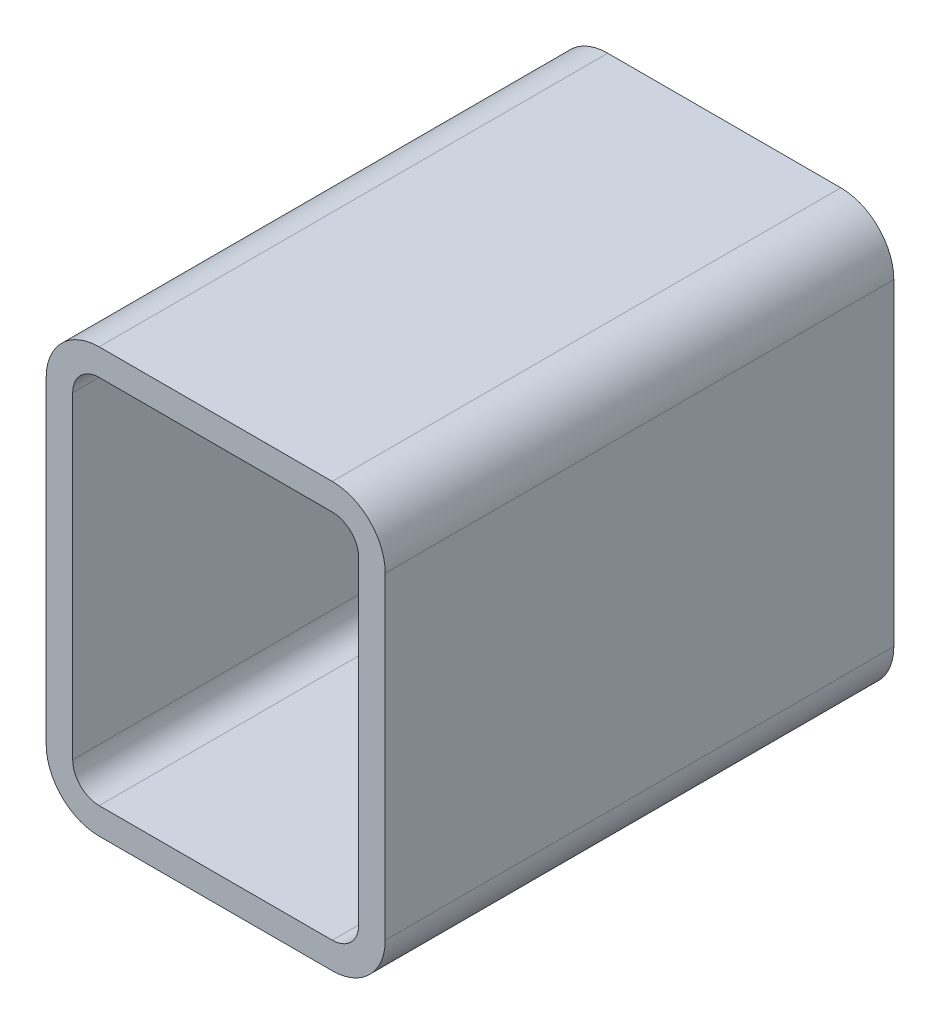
ISO-10303-21;
HEADER;
FILE_DESCRIPTION(('STEP AP214'),'2;1');
FILE_NAME('part.step','',(''),(''),'','','');
FILE_SCHEMA(('AUTOMOTIVE_DESIGN { 1 0 10303 214 1 1 1 1 }'));
ENDSEC;
DATA;
#1=APPLICATION_CONTEXT('core data for automotive mechanical design processes');
#2=APPLICATION_PROTOCOL_DEFINITION('international standard','automotive_design',2000,#1);
#3=PRODUCT_CONTEXT('',#1,'mechanical');
#4=PRODUCT('Part','Part','',(#3));
#5=PRODUCT_RELATED_PRODUCT_CATEGORY('part','',(#4));
#6=PRODUCT_DEFINITION_FORMATION('','',#4);
#7=PRODUCT_DEFINITION_CONTEXT('part definition',#1,'design');
#8=PRODUCT_DEFINITION('design','',#6,#7);
#9=PRODUCT_DEFINITION_SHAPE('','',#8);
#10=(LENGTH_UNIT() NAMED_UNIT(*) SI_UNIT(.MILLI.,.METRE.));
#11=(NAMED_UNIT(*) PLANE_ANGLE_UNIT() SI_UNIT($,.RADIAN.));
#12=(NAMED_UNIT(*) SI_UNIT($,.STERADIAN.) SOLID_ANGLE_UNIT());
#13=UNCERTAINTY_MEASURE_WITH_UNIT(LENGTH_MEASURE(1.E-05),#10,'distance_accuracy_value','');
#14=(GEOMETRIC_REPRESENTATION_CONTEXT(3) GLOBAL_UNCERTAINTY_ASSIGNED_CONTEXT((#13)) GLOBAL_UNIT_ASSIGNED_CONTEXT((#10,
#11,#12)) REPRESENTATION_CONTEXT('',''));
#15=CARTESIAN_POINT('',(0.,0.,0.));
#16=DIRECTION('',(0.,0.,1.));
#17=DIRECTION('',(1.,0.,0.));
#18=AXIS2_PLACEMENT_3D('',#15,#16,#17);
#19=CARTESIAN_POINT('',(33.1409404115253,224.170313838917,304.8));
#20=DIRECTION('',(0.,0.,1.));
#21=DIRECTION('',(1.,0.,0.));
#22=AXIS2_PLACEMENT_3D('',#19,#20,#21);
#23=PLANE('',#22);
#24=CARTESIAN_POINT('',(33.1409404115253,224.170313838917,304.8));
#25=DIRECTION('',(0.,0.,1.));
#26=DIRECTION('',(1.,0.,0.));
#27=AXIS2_PLACEMENT_3D('',#24,#25,#26);
#28=CIRCLE('',#27,31.75);
#29=CARTESIAN_POINT('',(33.1409404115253,255.920313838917,304.8));
#30=VERTEX_POINT('',#29);
#31=CARTESIAN_POINT('',(1.3909404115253,224.170313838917,304.8));
#32=VERTEX_POINT('',#31);
#33=EDGE_CURVE('E211',#30,#32,#28,.T.);
#34=ORIENTED_EDGE('',*,*,#33,.T.);
#35=DIRECTION('',(0.,-1.,0.));
#36=VECTOR('',#35,1.);
#37=CARTESIAN_POINT('',(1.3909404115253,33.6703138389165,304.8));
#38=LINE('',#37,#36);
#39=CARTESIAN_POINT('',(1.3909404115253,33.6703138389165,304.8));
#40=VERTEX_POINT('',#39);
#41=EDGE_CURVE('E214',#32,#40,#38,.T.);
#42=ORIENTED_EDGE('',*,*,#41,.T.);
#43=CARTESIAN_POINT('',(33.1409404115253,33.6703138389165,304.8));
#44=DIRECTION('',(0.,0.,1.));
#45=DIRECTION('',(1.,0.,0.));
#46=AXIS2_PLACEMENT_3D('',#43,#44,#45);
#47=CIRCLE('',#46,31.75);
#48=CARTESIAN_POINT('',(33.1409404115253,1.92031383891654,304.8));
#49=VERTEX_POINT('',#48);
#50=EDGE_CURVE('E217',#40,#49,#47,.T.);
#51=ORIENTED_EDGE('',*,*,#50,.T.);
#52=DIRECTION('',(1.,0.,0.));
#53=VECTOR('',#52,1.);
#54=CARTESIAN_POINT('',(172.840940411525,1.92031383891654,304.8));
#55=LINE('',#54,#53);
#56=CARTESIAN_POINT('',(172.840940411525,1.92031383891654,304.8));
#57=VERTEX_POINT('',#56);
#58=EDGE_CURVE('E219',#49,#57,#55,.T.);
#59=ORIENTED_EDGE('',*,*,#58,.T.);
#60=CARTESIAN_POINT('',(172.840940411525,33.6703138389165,304.8));
#61=DIRECTION('',(0.,0.,1.));
#62=DIRECTION('',(1.,0.,0.));
#63=AXIS2_PLACEMENT_3D('',#60,#61,#62);
#64=CIRCLE('',#63,31.75);
#65=CARTESIAN_POINT('',(204.590940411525,33.6703138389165,304.8));
#66=VERTEX_POINT('',#65);
#67=EDGE_CURVE('E221',#57,#66,#64,.T.);
#68=ORIENTED_EDGE('',*,*,#67,.T.);
#69=DIRECTION('',(0.,1.,0.));
#70=VECTOR('',#69,1.);
#71=CARTESIAN_POINT('',(204.590940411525,224.170313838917,304.8));
#72=LINE('',#71,#70);
#73=CARTESIAN_POINT('',(204.590940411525,224.170313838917,304.8));
#74=VERTEX_POINT('',#73);
#75=EDGE_CURVE('E223',#66,#74,#72,.T.);
#76=ORIENTED_EDGE('',*,*,#75,.T.);
#77=CARTESIAN_POINT('',(172.840940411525,224.170313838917,304.8));
#78=DIRECTION('',(0.,0.,1.));
#79=DIRECTION('',(1.,0.,0.));
#80=AXIS2_PLACEMENT_3D('',#77,#78,#79);
#81=CIRCLE('',#80,31.75);
#82=CARTESIAN_POINT('',(172.840940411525,255.920313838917,304.8));
#83=VERTEX_POINT('',#82);
#84=EDGE_CURVE('E225',#74,#83,#81,.T.);
#85=ORIENTED_EDGE('',*,*,#84,.T.);
#86=DIRECTION('',(-1.,0.,0.));
#87=VECTOR('',#86,1.);
#88=CARTESIAN_POINT('',(33.1409404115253,255.920313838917,304.8));
#89=LINE('',#88,#87);
#90=EDGE_CURVE('E227',#83,#30,#89,.T.);
#91=ORIENTED_EDGE('',*,*,#90,.T.);
#92=EDGE_LOOP('',(#34,#42,#51,#59,#68,#76,#85,#91));
#93=FACE_BOUND('',#92,.T.);
#94=DIRECTION('',(0.,-1.,0.));
#95=VECTOR('',#94,1.);
#96=CARTESIAN_POINT('',(17.2659404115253,33.6703138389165,304.8));
#97=LINE('',#96,#95);
#98=CARTESIAN_POINT('',(17.2659404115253,224.170313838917,304.8));
#99=VERTEX_POINT('',#98);
#100=CARTESIAN_POINT('',(17.2659404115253,33.6703138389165,304.8));
#101=VERTEX_POINT('',#100);
#102=EDGE_CURVE('E154',#99,#101,#97,.T.);
#103=ORIENTED_EDGE('',*,*,#102,.F.);
#104=CARTESIAN_POINT('',(33.1409404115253,224.170313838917,304.8));
#105=DIRECTION('',(0.,0.,1.));
#106=DIRECTION('',(1.,0.,0.));
#107=AXIS2_PLACEMENT_3D('',#104,#105,#106);
#108=CIRCLE('',#107,15.875);
#109=CARTESIAN_POINT('',(33.1409404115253,240.045313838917,304.8));
#110=VERTEX_POINT('',#109);
#111=EDGE_CURVE('E146',#110,#99,#108,.T.);
#112=ORIENTED_EDGE('',*,*,#111,.F.);
#113=DIRECTION('',(-1.,0.,0.));
#114=VECTOR('',#113,1.);
#115=CARTESIAN_POINT('',(33.1409404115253,240.045313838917,304.8));
#116=LINE('',#115,#114);
#117=CARTESIAN_POINT('',(172.840940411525,240.045313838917,304.8));
#118=VERTEX_POINT('',#117);
#119=EDGE_CURVE('E179',#118,#110,#116,.T.);
#120=ORIENTED_EDGE('',*,*,#119,.F.);
#121=CARTESIAN_POINT('',(172.840940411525,224.170313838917,304.8));
#122=DIRECTION('',(0.,0.,1.));
#123=DIRECTION('',(1.,0.,0.));
#124=AXIS2_PLACEMENT_3D('',#121,#122,#123);
#125=CIRCLE('',#124,15.875);
#126=CARTESIAN_POINT('',(188.715940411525,224.170313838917,304.8));
#127=VERTEX_POINT('',#126);
#128=EDGE_CURVE('E177',#127,#118,#125,.T.);
#129=ORIENTED_EDGE('',*,*,#128,.F.);
#130=DIRECTION('',(0.,1.,0.));
#131=VECTOR('',#130,1.);
#132=CARTESIAN_POINT('',(188.715940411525,224.170313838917,304.8));
#133=LINE('',#132,#131);
#134=CARTESIAN_POINT('',(188.715940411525,33.6703138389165,304.8));
#135=VERTEX_POINT('',#134);
#136=EDGE_CURVE('E175',#135,#127,#133,.T.);
#137=ORIENTED_EDGE('',*,*,#136,.F.);
#138=CARTESIAN_POINT('',(172.840940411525,33.6703138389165,304.8));
#139=DIRECTION('',(0.,0.,1.));
#140=DIRECTION('',(1.,0.,0.));
#141=AXIS2_PLACEMENT_3D('',#138,#139,#140);
#142=CIRCLE('',#141,15.875);
#143=CARTESIAN_POINT('',(172.840940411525,17.7953138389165,304.8));
#144=VERTEX_POINT('',#143);
#145=EDGE_CURVE('E173',#144,#135,#142,.T.);
#146=ORIENTED_EDGE('',*,*,#145,.F.);
#147=DIRECTION('',(1.,0.,0.));
#148=VECTOR('',#147,1.);
#149=CARTESIAN_POINT('',(172.840940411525,17.7953138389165,304.8));
#150=LINE('',#149,#148);
#151=CARTESIAN_POINT('',(33.1409404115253,17.7953138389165,304.8));
#152=VERTEX_POINT('',#151);
#153=EDGE_CURVE('E169',#152,#144,#150,.T.);
#154=ORIENTED_EDGE('',*,*,#153,.F.);
#155=CARTESIAN_POINT('',(33.1409404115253,33.6703138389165,304.8));
#156=DIRECTION('',(0.,0.,1.));
#157=DIRECTION('',(1.,0.,0.));
#158=AXIS2_PLACEMENT_3D('',#155,#156,#157);
#159=CIRCLE('',#158,15.875);
#160=EDGE_CURVE('E167',#101,#152,#159,.T.);
#161=ORIENTED_EDGE('',*,*,#160,.F.);
#162=EDGE_LOOP('',(#103,#112,#120,#129,#137,#146,#154,#161));
#163=FACE_BOUND('',#162,.T.);
#164=ADVANCED_FACE('F33',(#93,#163),#23,.T.);
#165=CARTESIAN_POINT('',(33.1409404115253,224.170313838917,0.));
#166=DIRECTION('',(0.,0.,1.));
#167=DIRECTION('',(1.,0.,0.));
#168=AXIS2_PLACEMENT_3D('',#165,#166,#167);
#169=PLANE('',#168);
#170=CARTESIAN_POINT('',(33.1409404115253,224.170313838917,0.));
#171=DIRECTION('',(0.,0.,1.));
#172=DIRECTION('',(1.,0.,0.));
#173=AXIS2_PLACEMENT_3D('',#170,#171,#172);
#174=CIRCLE('',#173,31.75);
#175=CARTESIAN_POINT('',(33.1409404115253,255.920313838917,0.));
#176=VERTEX_POINT('',#175);
#177=CARTESIAN_POINT('',(1.3909404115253,224.170313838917,0.));
#178=VERTEX_POINT('',#177);
#179=EDGE_CURVE('E162',#176,#178,#174,.T.);
#180=ORIENTED_EDGE('',*,*,#179,.F.);
#181=DIRECTION('',(-1.,0.,0.));
#182=VECTOR('',#181,1.);
#183=CARTESIAN_POINT('',(33.1409404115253,255.920313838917,0.));
#184=LINE('',#183,#182);
#185=CARTESIAN_POINT('',(172.840940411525,255.920313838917,0.));
#186=VERTEX_POINT('',#185);
#187=EDGE_CURVE('E215',#186,#176,#184,.T.);
#188=ORIENTED_EDGE('',*,*,#187,.F.);
#189=CARTESIAN_POINT('',(172.840940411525,224.170313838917,0.));
#190=DIRECTION('',(0.,0.,1.));
#191=DIRECTION('',(1.,0.,0.));
#192=AXIS2_PLACEMENT_3D('',#189,#190,#191);
#193=CIRCLE('',#192,31.75);
#194=CARTESIAN_POINT('',(204.590940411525,224.170313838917,0.));
#195=VERTEX_POINT('',#194);
#196=EDGE_CURVE('E242',#195,#186,#193,.T.);
#197=ORIENTED_EDGE('',*,*,#196,.F.);
#198=DIRECTION('',(0.,1.,0.));
#199=VECTOR('',#198,1.);
#200=CARTESIAN_POINT('',(204.590940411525,224.170313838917,0.));
#201=LINE('',#200,#199);
#202=CARTESIAN_POINT('',(204.590940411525,33.6703138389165,0.));
#203=VERTEX_POINT('',#202);
#204=EDGE_CURVE('E240',#203,#195,#201,.T.);
#205=ORIENTED_EDGE('',*,*,#204,.F.);
#206=CARTESIAN_POINT('',(172.840940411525,33.6703138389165,0.));
#207=DIRECTION('',(0.,0.,1.));
#208=DIRECTION('',(1.,0.,0.));
#209=AXIS2_PLACEMENT_3D('',#206,#207,#208);
#210=CIRCLE('',#209,31.75);
#211=CARTESIAN_POINT('',(172.840940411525,1.92031383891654,0.));
#212=VERTEX_POINT('',#211);
#213=EDGE_CURVE('E238',#212,#203,#210,.T.);
#214=ORIENTED_EDGE('',*,*,#213,.F.);
#215=DIRECTION('',(1.,0.,0.));
#216=VECTOR('',#215,1.);
#217=CARTESIAN_POINT('',(172.840940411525,1.92031383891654,0.));
#218=LINE('',#217,#216);
#219=CARTESIAN_POINT('',(33.1409404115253,1.92031383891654,0.));
#220=VERTEX_POINT('',#219);
#221=EDGE_CURVE('E236',#220,#212,#218,.T.);
#222=ORIENTED_EDGE('',*,*,#221,.F.);
#223=CARTESIAN_POINT('',(33.1409404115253,33.6703138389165,0.));
#224=DIRECTION('',(0.,0.,1.));
#225=DIRECTION('',(1.,0.,0.));
#226=AXIS2_PLACEMENT_3D('',#223,#224,#225);
#227=CIRCLE('',#226,31.75);
#228=CARTESIAN_POINT('',(1.3909404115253,33.6703138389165,0.));
#229=VERTEX_POINT('',#228);
#230=EDGE_CURVE('E234',#229,#220,#227,.T.);
#231=ORIENTED_EDGE('',*,*,#230,.F.);
#232=DIRECTION('',(0.,-1.,0.));
#233=VECTOR('',#232,1.);
#234=CARTESIAN_POINT('',(1.3909404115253,33.6703138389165,0.));
#235=LINE('',#234,#233);
#236=EDGE_CURVE('E232',#178,#229,#235,.T.);
#237=ORIENTED_EDGE('',*,*,#236,.F.);
#238=EDGE_LOOP('',(#180,#188,#197,#205,#214,#222,#231,#237));
#239=FACE_BOUND('',#238,.T.);
#240=CARTESIAN_POINT('',(33.1409404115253,224.170313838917,0.));
#241=DIRECTION('',(0.,0.,1.));
#242=DIRECTION('',(1.,0.,0.));
#243=AXIS2_PLACEMENT_3D('',#240,#241,#242);
#244=CIRCLE('',#243,15.875);
#245=CARTESIAN_POINT('',(33.1409404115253,240.045313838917,0.));
#246=VERTEX_POINT('',#245);
#247=CARTESIAN_POINT('',(17.2659404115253,224.170313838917,0.));
#248=VERTEX_POINT('',#247);
#249=EDGE_CURVE('E56',#246,#248,#244,.T.);
#250=ORIENTED_EDGE('',*,*,#249,.T.);
#251=DIRECTION('',(0.,-1.,0.));
#252=VECTOR('',#251,1.);
#253=CARTESIAN_POINT('',(17.2659404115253,33.6703138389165,0.));
#254=LINE('',#253,#252);
#255=CARTESIAN_POINT('',(17.2659404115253,33.6703138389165,0.));
#256=VERTEX_POINT('',#255);
#257=EDGE_CURVE('E161',#248,#256,#254,.T.);
#258=ORIENTED_EDGE('',*,*,#257,.T.);
#259=CARTESIAN_POINT('',(33.1409404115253,33.6703138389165,0.));
#260=DIRECTION('',(0.,0.,1.));
#261=DIRECTION('',(1.,0.,0.));
#262=AXIS2_PLACEMENT_3D('',#259,#260,#261);
#263=CIRCLE('',#262,15.875);
#264=CARTESIAN_POINT('',(33.1409404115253,17.7953138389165,0.));
#265=VERTEX_POINT('',#264);
#266=EDGE_CURVE('E183',#256,#265,#263,.T.);
#267=ORIENTED_EDGE('',*,*,#266,.T.);
#268=DIRECTION('',(1.,0.,0.));
#269=VECTOR('',#268,1.);
#270=CARTESIAN_POINT('',(172.840940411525,17.7953138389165,0.));
#271=LINE('',#270,#269);
#272=CARTESIAN_POINT('',(172.840940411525,17.7953138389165,0.));
#273=VERTEX_POINT('',#272);
#274=EDGE_CURVE('E186',#265,#273,#271,.T.);
#275=ORIENTED_EDGE('',*,*,#274,.T.);
#276=CARTESIAN_POINT('',(172.840940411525,33.6703138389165,0.));
#277=DIRECTION('',(0.,0.,1.));
#278=DIRECTION('',(1.,0.,0.));
#279=AXIS2_PLACEMENT_3D('',#276,#277,#278);
#280=CIRCLE('',#279,15.875);
#281=CARTESIAN_POINT('',(188.715940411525,33.6703138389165,0.));
#282=VERTEX_POINT('',#281);
#283=EDGE_CURVE('E189',#273,#282,#280,.T.);
#284=ORIENTED_EDGE('',*,*,#283,.T.);
#285=DIRECTION('',(0.,1.,0.));
#286=VECTOR('',#285,1.);
#287=CARTESIAN_POINT('',(188.715940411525,224.170313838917,0.));
#288=LINE('',#287,#286);
#289=CARTESIAN_POINT('',(188.715940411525,224.170313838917,0.));
#290=VERTEX_POINT('',#289);
#291=EDGE_CURVE('E192',#282,#290,#288,.T.);
#292=ORIENTED_EDGE('',*,*,#291,.T.);
#293=CARTESIAN_POINT('',(172.840940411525,224.170313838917,0.));
#294=DIRECTION('',(0.,0.,1.));
#295=DIRECTION('',(1.,0.,0.));
#296=AXIS2_PLACEMENT_3D('',#293,#294,#295);
#297=CIRCLE('',#296,15.875);
#298=CARTESIAN_POINT('',(172.840940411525,240.045313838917,0.));
#299=VERTEX_POINT('',#298);
#300=EDGE_CURVE('E195',#290,#299,#297,.T.);
#301=ORIENTED_EDGE('',*,*,#300,.T.);
#302=DIRECTION('',(-1.,0.,0.));
#303=VECTOR('',#302,1.);
#304=CARTESIAN_POINT('',(33.1409404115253,240.045313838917,0.));
#305=LINE('',#304,#303);
#306=EDGE_CURVE('E155',#299,#246,#305,.T.);
#307=ORIENTED_EDGE('',*,*,#306,.T.);
#308=EDGE_LOOP('',(#250,#258,#267,#275,#284,#292,#301,#307));
#309=FACE_BOUND('',#308,.T.);
#310=ADVANCED_FACE('F272',(#239,#309),#169,.F.);
#311=CARTESIAN_POINT('',(33.1409404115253,224.170313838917,304.8));
#312=DIRECTION('',(0.,0.,-1.));
#313=DIRECTION('',(-1.,0.,0.));
#314=AXIS2_PLACEMENT_3D('',#311,#312,#313);
#315=CYLINDRICAL_SURFACE('',#314,31.75);
#316=ORIENTED_EDGE('',*,*,#179,.T.);
#317=DIRECTION('',(0.,0.,-1.));
#318=VECTOR('',#317,1.);
#319=CARTESIAN_POINT('',(1.3909404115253,224.170313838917,304.8));
#320=LINE('',#319,#318);
#321=EDGE_CURVE('E11',#32,#178,#320,.T.);
#322=ORIENTED_EDGE('',*,*,#321,.F.);
#323=ORIENTED_EDGE('',*,*,#33,.F.);
#324=DIRECTION('',(0.,0.,-1.));
#325=VECTOR('',#324,1.);
#326=CARTESIAN_POINT('',(33.1409404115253,255.920313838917,304.8));
#327=LINE('',#326,#325);
#328=EDGE_CURVE('E229',#30,#176,#327,.T.);
#329=ORIENTED_EDGE('',*,*,#328,.T.);
#330=EDGE_LOOP('',(#316,#322,#323,#329));
#331=FACE_BOUND('',#330,.T.);
#332=ADVANCED_FACE('F35',(#331),#315,.T.);
#333=CARTESIAN_POINT('',(1.3909404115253,33.6703138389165,304.8));
#334=DIRECTION('',(1.,0.,0.));
#335=DIRECTION('',(0.,0.,-1.));
#336=AXIS2_PLACEMENT_3D('',#333,#334,#335);
#337=PLANE('',#336);
#338=ORIENTED_EDGE('',*,*,#236,.T.);
#339=DIRECTION('',(0.,0.,-1.));
#340=VECTOR('',#339,1.);
#341=CARTESIAN_POINT('',(1.3909404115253,33.6703138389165,304.8));
#342=LINE('',#341,#340);
#343=EDGE_CURVE('E41',#40,#229,#342,.T.);
#344=ORIENTED_EDGE('',*,*,#343,.F.);
#345=ORIENTED_EDGE('',*,*,#41,.F.);
#346=ORIENTED_EDGE('',*,*,#321,.T.);
#347=EDGE_LOOP('',(#338,#344,#345,#346));
#348=FACE_BOUND('',#347,.T.);
#349=ADVANCED_FACE('F289',(#348),#337,.F.);
#350=CARTESIAN_POINT('',(33.1409404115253,33.6703138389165,304.8));
#351=DIRECTION('',(0.,0.,-1.));
#352=DIRECTION('',(-1.,0.,0.));
#353=AXIS2_PLACEMENT_3D('',#350,#351,#352);
#354=CYLINDRICAL_SURFACE('',#353,31.75);
#355=ORIENTED_EDGE('',*,*,#230,.T.);
#356=DIRECTION('',(0.,0.,-1.));
#357=VECTOR('',#356,1.);
#358=CARTESIAN_POINT('',(33.1409404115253,1.92031383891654,304.8));
#359=LINE('',#358,#357);
#360=EDGE_CURVE('E259',#49,#220,#359,.T.);
#361=ORIENTED_EDGE('',*,*,#360,.F.);
#362=ORIENTED_EDGE('',*,*,#50,.F.);
#363=ORIENTED_EDGE('',*,*,#343,.T.);
#364=EDGE_LOOP('',(#355,#361,#362,#363));
#365=FACE_BOUND('',#364,.T.);
#366=ADVANCED_FACE('F266',(#365),#354,.T.);
#367=CARTESIAN_POINT('',(172.840940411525,1.92031383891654,304.8));
#368=DIRECTION('',(0.,1.,0.));
#369=DIRECTION('',(0.,0.,1.));
#370=AXIS2_PLACEMENT_3D('',#367,#368,#369);
#371=PLANE('',#370);
#372=ORIENTED_EDGE('',*,*,#221,.T.);
#373=DIRECTION('',(0.,0.,-1.));
#374=VECTOR('',#373,1.);
#375=CARTESIAN_POINT('',(172.840940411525,1.92031383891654,304.8));
#376=LINE('',#375,#374);
#377=EDGE_CURVE('E256',#57,#212,#376,.T.);
#378=ORIENTED_EDGE('',*,*,#377,.F.);
#379=ORIENTED_EDGE('',*,*,#58,.F.);
#380=ORIENTED_EDGE('',*,*,#360,.T.);
#381=EDGE_LOOP('',(#372,#378,#379,#380));
#382=FACE_BOUND('',#381,.T.);
#383=ADVANCED_FACE('F278',(#382),#371,.F.);
#384=CARTESIAN_POINT('',(172.840940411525,33.6703138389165,304.8));
#385=DIRECTION('',(0.,0.,-1.));
#386=DIRECTION('',(-1.,0.,0.));
#387=AXIS2_PLACEMENT_3D('',#384,#385,#386);
#388=CYLINDRICAL_SURFACE('',#387,31.75);
#389=ORIENTED_EDGE('',*,*,#213,.T.);
#390=DIRECTION('',(0.,0.,-1.));
#391=VECTOR('',#390,1.);
#392=CARTESIAN_POINT('',(204.590940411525,33.6703138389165,304.8));
#393=LINE('',#392,#391);
#394=EDGE_CURVE('E253',#66,#203,#393,.T.);
#395=ORIENTED_EDGE('',*,*,#394,.F.);
#396=ORIENTED_EDGE('',*,*,#67,.F.);
#397=ORIENTED_EDGE('',*,*,#377,.T.);
#398=EDGE_LOOP('',(#389,#395,#396,#397));
#399=FACE_BOUND('',#398,.T.);
#400=ADVANCED_FACE('F282',(#399),#388,.T.);
#401=CARTESIAN_POINT('',(204.590940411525,224.170313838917,304.8));
#402=DIRECTION('',(-1.,0.,0.));
#403=DIRECTION('',(0.,0.,1.));
#404=AXIS2_PLACEMENT_3D('',#401,#402,#403);
#405=PLANE('',#404);
#406=ORIENTED_EDGE('',*,*,#204,.T.);
#407=DIRECTION('',(0.,0.,-1.));
#408=VECTOR('',#407,1.);
#409=CARTESIAN_POINT('',(204.590940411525,224.170313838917,304.8));
#410=LINE('',#409,#408);
#411=EDGE_CURVE('E250',#74,#195,#410,.T.);
#412=ORIENTED_EDGE('',*,*,#411,.F.);
#413=ORIENTED_EDGE('',*,*,#75,.F.);
#414=ORIENTED_EDGE('',*,*,#394,.T.);
#415=EDGE_LOOP('',(#406,#412,#413,#414));
#416=FACE_BOUND('',#415,.T.);
#417=ADVANCED_FACE('F302',(#416),#405,.F.);
#418=CARTESIAN_POINT('',(172.840940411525,224.170313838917,304.8));
#419=DIRECTION('',(0.,0.,-1.));
#420=DIRECTION('',(-1.,0.,0.));
#421=AXIS2_PLACEMENT_3D('',#418,#419,#420);
#422=CYLINDRICAL_SURFACE('',#421,31.75);
#423=ORIENTED_EDGE('',*,*,#196,.T.);
#424=DIRECTION('',(0.,0.,-1.));
#425=VECTOR('',#424,1.);
#426=CARTESIAN_POINT('',(172.840940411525,255.920313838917,304.8));
#427=LINE('',#426,#425);
#428=EDGE_CURVE('E247',#83,#186,#427,.T.);
#429=ORIENTED_EDGE('',*,*,#428,.F.);
#430=ORIENTED_EDGE('',*,*,#84,.F.);
#431=ORIENTED_EDGE('',*,*,#411,.T.);
#432=EDGE_LOOP('',(#423,#429,#430,#431));
#433=FACE_BOUND('',#432,.T.);
#434=ADVANCED_FACE('F300',(#433),#422,.T.);
#435=CARTESIAN_POINT('',(33.1409404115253,255.920313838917,304.8));
#436=DIRECTION('',(0.,-1.,0.));
#437=DIRECTION('',(0.,0.,-1.));
#438=AXIS2_PLACEMENT_3D('',#435,#436,#437);
#439=PLANE('',#438);
#440=ORIENTED_EDGE('',*,*,#187,.T.);
#441=ORIENTED_EDGE('',*,*,#328,.F.);
#442=ORIENTED_EDGE('',*,*,#90,.F.);
#443=ORIENTED_EDGE('',*,*,#428,.T.);
#444=EDGE_LOOP('',(#440,#441,#442,#443));
#445=FACE_BOUND('',#444,.T.);
#446=ADVANCED_FACE('F295',(#445),#439,.F.);
#447=CARTESIAN_POINT('',(33.1409404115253,224.170313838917,304.8));
#448=DIRECTION('',(0.,0.,-1.));
#449=DIRECTION('',(-1.,0.,0.));
#450=AXIS2_PLACEMENT_3D('',#447,#448,#449);
#451=CYLINDRICAL_SURFACE('',#450,15.875);
#452=ORIENTED_EDGE('',*,*,#249,.F.);
#453=DIRECTION('',(0.,0.,-1.));
#454=VECTOR('',#453,1.);
#455=CARTESIAN_POINT('',(33.1409404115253,240.045313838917,304.8));
#456=LINE('',#455,#454);
#457=EDGE_CURVE('E150',#110,#246,#456,.T.);
#458=ORIENTED_EDGE('',*,*,#457,.F.);
#459=ORIENTED_EDGE('',*,*,#111,.T.);
#460=DIRECTION('',(0.,0.,-1.));
#461=VECTOR('',#460,1.);
#462=CARTESIAN_POINT('',(17.2659404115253,224.170313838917,304.8));
#463=LINE('',#462,#461);
#464=EDGE_CURVE('E149',#99,#248,#463,.T.);
#465=ORIENTED_EDGE('',*,*,#464,.T.);
#466=EDGE_LOOP('',(#452,#458,#459,#465));
#467=FACE_BOUND('',#466,.T.);
#468=ADVANCED_FACE('F148',(#467),#451,.F.);
#469=CARTESIAN_POINT('',(17.2659404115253,33.6703138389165,304.8));
#470=DIRECTION('',(1.,0.,0.));
#471=DIRECTION('',(0.,0.,-1.));
#472=AXIS2_PLACEMENT_3D('',#469,#470,#471);
#473=PLANE('',#472);
#474=ORIENTED_EDGE('',*,*,#257,.F.);
#475=ORIENTED_EDGE('',*,*,#464,.F.);
#476=ORIENTED_EDGE('',*,*,#102,.T.);
#477=DIRECTION('',(0.,0.,-1.));
#478=VECTOR('',#477,1.);
#479=CARTESIAN_POINT('',(17.2659404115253,33.6703138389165,304.8));
#480=LINE('',#479,#478);
#481=EDGE_CURVE('E163',#101,#256,#480,.T.);
#482=ORIENTED_EDGE('',*,*,#481,.T.);
#483=EDGE_LOOP('',(#474,#475,#476,#482));
#484=FACE_BOUND('',#483,.T.);
#485=ADVANCED_FACE('F158',(#484),#473,.T.);
#486=CARTESIAN_POINT('',(33.1409404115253,33.6703138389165,304.8));
#487=DIRECTION('',(0.,0.,-1.));
#488=DIRECTION('',(-1.,0.,0.));
#489=AXIS2_PLACEMENT_3D('',#486,#487,#488);
#490=CYLINDRICAL_SURFACE('',#489,15.875);
#491=ORIENTED_EDGE('',*,*,#266,.F.);
#492=ORIENTED_EDGE('',*,*,#481,.F.);
#493=ORIENTED_EDGE('',*,*,#160,.T.);
#494=DIRECTION('',(0.,0.,-1.));
#495=VECTOR('',#494,1.);
#496=CARTESIAN_POINT('',(33.1409404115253,17.7953138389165,304.8));
#497=LINE('',#496,#495);
#498=EDGE_CURVE('E208',#152,#265,#497,.T.);
#499=ORIENTED_EDGE('',*,*,#498,.T.);
#500=EDGE_LOOP('',(#491,#492,#493,#499));
#501=FACE_BOUND('',#500,.T.);
#502=ADVANCED_FACE('F327',(#501),#490,.F.);
#503=CARTESIAN_POINT('',(172.840940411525,17.7953138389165,304.8));
#504=DIRECTION('',(0.,1.,0.));
#505=DIRECTION('',(0.,0.,1.));
#506=AXIS2_PLACEMENT_3D('',#503,#504,#505);
#507=PLANE('',#506);
#508=ORIENTED_EDGE('',*,*,#274,.F.);
#509=ORIENTED_EDGE('',*,*,#498,.F.);
#510=ORIENTED_EDGE('',*,*,#153,.T.);
#511=DIRECTION('',(0.,0.,-1.));
#512=VECTOR('',#511,1.);
#513=CARTESIAN_POINT('',(172.840940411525,17.7953138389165,304.8));
#514=LINE('',#513,#512);
#515=EDGE_CURVE('E206',#144,#273,#514,.T.);
#516=ORIENTED_EDGE('',*,*,#515,.T.);
#517=EDGE_LOOP('',(#508,#509,#510,#516));
#518=FACE_BOUND('',#517,.T.);
#519=ADVANCED_FACE('F331',(#518),#507,.T.);
#520=CARTESIAN_POINT('',(172.840940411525,33.6703138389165,304.8));
#521=DIRECTION('',(0.,0.,-1.));
#522=DIRECTION('',(-1.,0.,0.));
#523=AXIS2_PLACEMENT_3D('',#520,#521,#522);
#524=CYLINDRICAL_SURFACE('',#523,15.875);
#525=ORIENTED_EDGE('',*,*,#283,.F.);
#526=ORIENTED_EDGE('',*,*,#515,.F.);
#527=ORIENTED_EDGE('',*,*,#145,.T.);
#528=DIRECTION('',(0.,0.,-1.));
#529=VECTOR('',#528,1.);
#530=CARTESIAN_POINT('',(188.715940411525,33.6703138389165,304.8));
#531=LINE('',#530,#529);
#532=EDGE_CURVE('E204',#135,#282,#531,.T.);
#533=ORIENTED_EDGE('',*,*,#532,.T.);
#534=EDGE_LOOP('',(#525,#526,#527,#533));
#535=FACE_BOUND('',#534,.T.);
#536=ADVANCED_FACE('F337',(#535),#524,.F.);
#537=CARTESIAN_POINT('',(188.715940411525,224.170313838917,304.8));
#538=DIRECTION('',(-1.,0.,0.));
#539=DIRECTION('',(0.,0.,1.));
#540=AXIS2_PLACEMENT_3D('',#537,#538,#539);
#541=PLANE('',#540);
#542=ORIENTED_EDGE('',*,*,#291,.F.);
#543=ORIENTED_EDGE('',*,*,#532,.F.);
#544=ORIENTED_EDGE('',*,*,#136,.T.);
#545=DIRECTION('',(0.,0.,-1.));
#546=VECTOR('',#545,1.);
#547=CARTESIAN_POINT('',(188.715940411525,224.170313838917,304.8));
#548=LINE('',#547,#546);
#549=EDGE_CURVE('E202',#127,#290,#548,.T.);
#550=ORIENTED_EDGE('',*,*,#549,.T.);
#551=EDGE_LOOP('',(#542,#543,#544,#550));
#552=FACE_BOUND('',#551,.T.);
#553=ADVANCED_FACE('F341',(#552),#541,.T.);
#554=CARTESIAN_POINT('',(172.840940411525,224.170313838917,304.8));
#555=DIRECTION('',(0.,0.,-1.));
#556=DIRECTION('',(-1.,0.,0.));
#557=AXIS2_PLACEMENT_3D('',#554,#555,#556);
#558=CYLINDRICAL_SURFACE('',#557,15.875);
#559=ORIENTED_EDGE('',*,*,#300,.F.);
#560=ORIENTED_EDGE('',*,*,#549,.F.);
#561=ORIENTED_EDGE('',*,*,#128,.T.);
#562=DIRECTION('',(0.,0.,-1.));
#563=VECTOR('',#562,1.);
#564=CARTESIAN_POINT('',(172.840940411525,240.045313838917,304.8));
#565=LINE('',#564,#563);
#566=EDGE_CURVE('E48',#118,#299,#565,.T.);
#567=ORIENTED_EDGE('',*,*,#566,.T.);
#568=EDGE_LOOP('',(#559,#560,#561,#567));
#569=FACE_BOUND('',#568,.T.);
#570=ADVANCED_FACE('F345',(#569),#558,.F.);
#571=CARTESIAN_POINT('',(33.1409404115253,240.045313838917,304.8));
#572=DIRECTION('',(0.,-1.,0.));
#573=DIRECTION('',(0.,0.,-1.));
#574=AXIS2_PLACEMENT_3D('',#571,#572,#573);
#575=PLANE('',#574);
#576=ORIENTED_EDGE('',*,*,#306,.F.);
#577=ORIENTED_EDGE('',*,*,#566,.F.);
#578=ORIENTED_EDGE('',*,*,#119,.T.);
#579=ORIENTED_EDGE('',*,*,#457,.T.);
#580=EDGE_LOOP('',(#576,#577,#578,#579));
#581=FACE_BOUND('',#580,.T.);
#582=ADVANCED_FACE('F349',(#581),#575,.T.);
#583=CLOSED_SHELL('',(#164,#310,#332,#349,#366,#383,#400,#417,#434,#446,#468,#485,#502,#519,
#536,#553,#570,#582));
#584=MANIFOLD_SOLID_BREP('B2',#583);
#585=ADVANCED_BREP_SHAPE_REPRESENTATION('',(#18,#584),#14);
#586=SHAPE_DEFINITION_REPRESENTATION(#9,#585);
ENDSEC;
END-ISO-10303-21;
